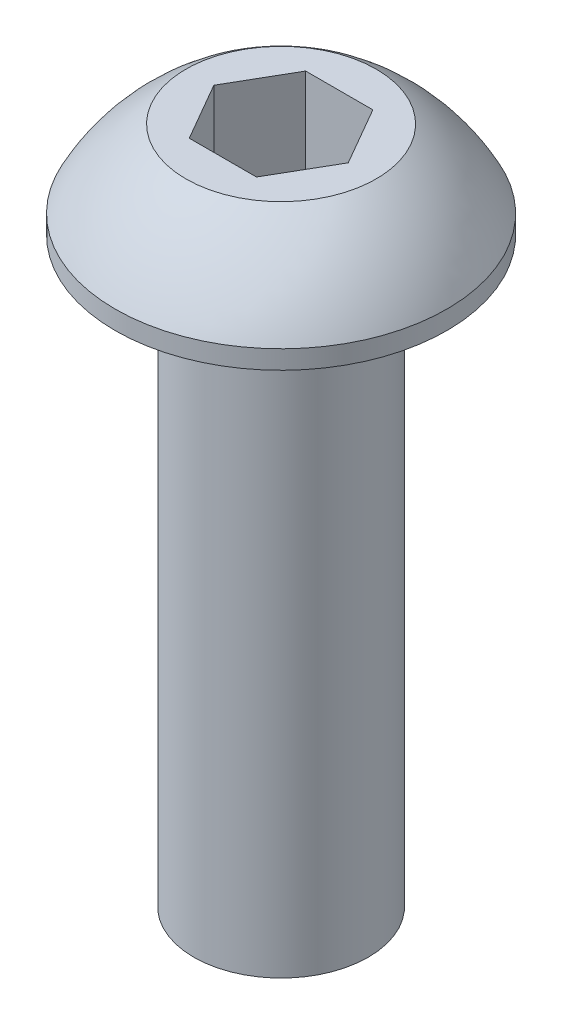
ISO-10303-21;
HEADER;
FILE_DESCRIPTION(('STEP AP214'),'2;1');
FILE_NAME('part.step','',(''),(''),'','','');
FILE_SCHEMA(('AUTOMOTIVE_DESIGN { 1 0 10303 214 1 1 1 1 }'));
ENDSEC;
DATA;
#1=APPLICATION_CONTEXT('core data for automotive mechanical design processes');
#2=APPLICATION_PROTOCOL_DEFINITION('international standard','automotive_design',2000,#1);
#3=PRODUCT_CONTEXT('',#1,'mechanical');
#4=PRODUCT('Part','Part','',(#3));
#5=PRODUCT_RELATED_PRODUCT_CATEGORY('part','',(#4));
#6=PRODUCT_DEFINITION_FORMATION('','',#4);
#7=PRODUCT_DEFINITION_CONTEXT('part definition',#1,'design');
#8=PRODUCT_DEFINITION('design','',#6,#7);
#9=PRODUCT_DEFINITION_SHAPE('','',#8);
#10=(LENGTH_UNIT() NAMED_UNIT(*) SI_UNIT(.MILLI.,.METRE.));
#11=(NAMED_UNIT(*) PLANE_ANGLE_UNIT() SI_UNIT($,.RADIAN.));
#12=(NAMED_UNIT(*) SI_UNIT($,.STERADIAN.) SOLID_ANGLE_UNIT());
#13=UNCERTAINTY_MEASURE_WITH_UNIT(LENGTH_MEASURE(1.E-05),#10,'distance_accuracy_value','');
#14=(GEOMETRIC_REPRESENTATION_CONTEXT(3) GLOBAL_UNCERTAINTY_ASSIGNED_CONTEXT((#13)) GLOBAL_UNIT_ASSIGNED_CONTEXT((#10,
#11,#12)) REPRESENTATION_CONTEXT('',''));
#15=CARTESIAN_POINT('',(0.,0.,0.));
#16=DIRECTION('',(0.,0.,1.));
#17=DIRECTION('',(1.,0.,0.));
#18=AXIS2_PLACEMENT_3D('',#15,#16,#17);
#19=CARTESIAN_POINT('',(0.,1.65,0.));
#20=DIRECTION('',(0.,-1.,0.));
#21=DIRECTION('',(0.,0.,-1.));
#22=AXIS2_PLACEMENT_3D('',#19,#20,#21);
#23=PLANE('',#22);
#24=DIRECTION('',(0.499999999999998,0.,-0.866025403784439));
#25=VECTOR('',#24,1.);
#26=CARTESIAN_POINT('',(0.577350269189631,1.65,1.));
#27=LINE('',#26,#25);
#28=CARTESIAN_POINT('',(0.577350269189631,1.65,1.));
#29=VERTEX_POINT('',#28);
#30=CARTESIAN_POINT('',(1.15470053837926,1.65,0.));
#31=VERTEX_POINT('',#30);
#32=EDGE_CURVE('E129',#29,#31,#27,.T.);
#33=ORIENTED_EDGE('',*,*,#32,.F.);
#34=DIRECTION('',(1.,0.,0.));
#35=VECTOR('',#34,1.);
#36=CARTESIAN_POINT('',(0.577350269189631,1.65,1.));
#37=LINE('',#36,#35);
#38=CARTESIAN_POINT('',(-0.577350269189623,1.65,1.));
#39=VERTEX_POINT('',#38);
#40=EDGE_CURVE('E55',#39,#29,#37,.T.);
#41=ORIENTED_EDGE('',*,*,#40,.F.);
#42=DIRECTION('',(0.500000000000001,0.,0.866025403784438));
#43=VECTOR('',#42,1.);
#44=CARTESIAN_POINT('',(-1.15470053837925,1.65,0.));
#45=LINE('',#44,#43);
#46=CARTESIAN_POINT('',(-1.15470053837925,1.65,0.));
#47=VERTEX_POINT('',#46);
#48=EDGE_CURVE('E138',#47,#39,#45,.T.);
#49=ORIENTED_EDGE('',*,*,#48,.F.);
#50=DIRECTION('',(-0.500000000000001,0.,0.866025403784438));
#51=VECTOR('',#50,1.);
#52=CARTESIAN_POINT('',(-1.15470053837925,1.65,0.));
#53=LINE('',#52,#51);
#54=CARTESIAN_POINT('',(-0.577350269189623,1.65,-1.));
#55=VERTEX_POINT('',#54);
#56=EDGE_CURVE('E136',#55,#47,#53,.T.);
#57=ORIENTED_EDGE('',*,*,#56,.F.);
#58=DIRECTION('',(-1.,0.,0.));
#59=VECTOR('',#58,1.);
#60=CARTESIAN_POINT('',(0.57735026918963,1.65,-1.));
#61=LINE('',#60,#59);
#62=CARTESIAN_POINT('',(0.57735026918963,1.65,-1.));
#63=VERTEX_POINT('',#62);
#64=EDGE_CURVE('E103',#63,#55,#61,.T.);
#65=ORIENTED_EDGE('',*,*,#64,.F.);
#66=DIRECTION('',(-0.499999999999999,0.,-0.866025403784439));
#67=VECTOR('',#66,1.);
#68=CARTESIAN_POINT('',(0.57735026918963,1.65,-1.));
#69=LINE('',#68,#67);
#70=EDGE_CURVE('E132',#31,#63,#69,.T.);
#71=ORIENTED_EDGE('',*,*,#70,.F.);
#72=EDGE_LOOP('',(#33,#41,#49,#57,#65,#71));
#73=FACE_BOUND('',#72,.T.);
#74=CARTESIAN_POINT('',(0.,1.65,0.));
#75=DIRECTION('',(0.,1.,0.));
#76=DIRECTION('',(0.,0.,1.));
#77=AXIS2_PLACEMENT_3D('',#74,#75,#76);
#78=CIRCLE('',#77,1.63497817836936);
#79=CARTESIAN_POINT('',(0.,1.65,1.63497817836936));
#80=VERTEX_POINT('',#79);
#81=EDGE_CURVE('E11',#80,#80,#78,.T.);
#82=ORIENTED_EDGE('',*,*,#81,.T.);
#83=EDGE_LOOP('',(#82));
#84=FACE_BOUND('',#83,.T.);
#85=ADVANCED_FACE('F41',(#73,#84),#23,.F.);
#86=CARTESIAN_POINT('',(0.,-1.20255616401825,0.));
#87=DIRECTION('',(0.,1.,0.));
#88=DIRECTION('',(0.,0.,1.));
#89=AXIS2_PLACEMENT_3D('',#86,#87,#88);
#90=DEGENERATE_TOROIDAL_SURFACE('',#89,0.151780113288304,3.36594442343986,.F.);
#91=ORIENTED_EDGE('',*,*,#81,.F.);
#92=EDGE_LOOP('',(#91));
#93=FACE_BOUND('',#92,.T.);
#94=CARTESIAN_POINT('',(0.,0.320236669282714,0.));
#95=DIRECTION('',(0.,1.,0.));
#96=DIRECTION('',(0.,0.,1.));
#97=AXIS2_PLACEMENT_3D('',#94,#95,#96);
#98=CIRCLE('',#97,2.85);
#99=CARTESIAN_POINT('',(0.,0.320236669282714,2.85));
#100=VERTEX_POINT('',#99);
#101=EDGE_CURVE('E48',#100,#100,#98,.T.);
#102=ORIENTED_EDGE('',*,*,#101,.T.);
#103=EDGE_LOOP('',(#102));
#104=FACE_BOUND('',#103,.T.);
#105=ADVANCED_FACE('F158',(#93,#104),#90,.F.);
#106=CARTESIAN_POINT('',(0.,9.90721096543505,0.));
#107=DIRECTION('',(0.,1.,0.));
#108=DIRECTION('',(0.,0.,1.));
#109=AXIS2_PLACEMENT_3D('',#106,#107,#108);
#110=CYLINDRICAL_SURFACE('',#109,2.85);
#111=ORIENTED_EDGE('',*,*,#101,.F.);
#112=EDGE_LOOP('',(#111));
#113=FACE_BOUND('',#112,.T.);
#114=CARTESIAN_POINT('',(0.,0.,0.));
#115=DIRECTION('',(0.,1.,0.));
#116=DIRECTION('',(0.,0.,1.));
#117=AXIS2_PLACEMENT_3D('',#114,#115,#116);
#118=CIRCLE('',#117,2.85);
#119=CARTESIAN_POINT('',(0.,0.,2.85));
#120=VERTEX_POINT('',#119);
#121=EDGE_CURVE('E153',#120,#120,#118,.T.);
#122=ORIENTED_EDGE('',*,*,#121,.T.);
#123=EDGE_LOOP('',(#122));
#124=FACE_BOUND('',#123,.T.);
#125=ADVANCED_FACE('F160',(#113,#124),#110,.T.);
#126=CARTESIAN_POINT('',(2.85,0.,0.));
#127=DIRECTION('',(0.,1.,0.));
#128=DIRECTION('',(0.,0.,1.));
#129=AXIS2_PLACEMENT_3D('',#126,#127,#128);
#130=PLANE('',#129);
#131=ORIENTED_EDGE('',*,*,#121,.F.);
#132=EDGE_LOOP('',(#131));
#133=FACE_BOUND('',#132,.T.);
#134=CARTESIAN_POINT('',(0.,0.,0.));
#135=DIRECTION('',(0.,1.,0.));
#136=DIRECTION('',(0.,0.,1.));
#137=AXIS2_PLACEMENT_3D('',#134,#135,#136);
#138=CIRCLE('',#137,1.5);
#139=CARTESIAN_POINT('',(0.,0.,1.5));
#140=VERTEX_POINT('',#139);
#141=EDGE_CURVE('E150',#140,#140,#138,.T.);
#142=ORIENTED_EDGE('',*,*,#141,.T.);
#143=EDGE_LOOP('',(#142));
#144=FACE_BOUND('',#143,.T.);
#145=ADVANCED_FACE('F163',(#133,#144),#130,.F.);
#146=CARTESIAN_POINT('',(0.,9.90721096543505,0.));
#147=DIRECTION('',(0.,1.,0.));
#148=DIRECTION('',(0.,0.,1.));
#149=AXIS2_PLACEMENT_3D('',#146,#147,#148);
#150=CYLINDRICAL_SURFACE('',#149,1.5);
#151=ORIENTED_EDGE('',*,*,#141,.F.);
#152=EDGE_LOOP('',(#151));
#153=FACE_BOUND('',#152,.T.);
#154=CARTESIAN_POINT('',(0.,-10.,0.));
#155=DIRECTION('',(0.,1.,0.));
#156=DIRECTION('',(0.,0.,1.));
#157=AXIS2_PLACEMENT_3D('',#154,#155,#156);
#158=CIRCLE('',#157,1.5);
#159=CARTESIAN_POINT('',(0.,-10.,1.5));
#160=VERTEX_POINT('',#159);
#161=EDGE_CURVE('E142',#160,#160,#158,.T.);
#162=ORIENTED_EDGE('',*,*,#161,.T.);
#163=EDGE_LOOP('',(#162));
#164=FACE_BOUND('',#163,.T.);
#165=ADVANCED_FACE('F169',(#153,#164),#150,.T.);
#166=CARTESIAN_POINT('',(1.5,-10.,0.));
#167=DIRECTION('',(0.,1.,0.));
#168=DIRECTION('',(0.,0.,1.));
#169=AXIS2_PLACEMENT_3D('',#166,#167,#168);
#170=PLANE('',#169);
#171=ORIENTED_EDGE('',*,*,#161,.F.);
#172=EDGE_LOOP('',(#171));
#173=FACE_BOUND('',#172,.T.);
#174=ADVANCED_FACE('F175',(#173),#170,.F.);
#175=CARTESIAN_POINT('',(0.577350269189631,0.125999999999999,1.));
#176=DIRECTION('',(0.,0.,1.));
#177=DIRECTION('',(1.,0.,0.));
#178=AXIS2_PLACEMENT_3D('',#175,#176,#177);
#179=PLANE('',#178);
#180=ORIENTED_EDGE('',*,*,#40,.T.);
#181=DIRECTION('',(0.,1.,0.));
#182=VECTOR('',#181,1.);
#183=CARTESIAN_POINT('',(0.577350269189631,0.125999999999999,1.));
#184=LINE('',#183,#182);
#185=CARTESIAN_POINT('',(0.577350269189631,0.125999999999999,1.));
#186=VERTEX_POINT('',#185);
#187=EDGE_CURVE('E85',#186,#29,#184,.T.);
#188=ORIENTED_EDGE('',*,*,#187,.F.);
#189=DIRECTION('',(1.,0.,0.));
#190=VECTOR('',#189,1.);
#191=CARTESIAN_POINT('',(0.577350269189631,0.125999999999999,1.));
#192=LINE('',#191,#190);
#193=CARTESIAN_POINT('',(-0.577350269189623,0.125999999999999,1.));
#194=VERTEX_POINT('',#193);
#195=EDGE_CURVE('E140',#194,#186,#192,.T.);
#196=ORIENTED_EDGE('',*,*,#195,.F.);
#197=DIRECTION('',(0.,1.,0.));
#198=VECTOR('',#197,1.);
#199=CARTESIAN_POINT('',(-0.577350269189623,0.125999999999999,1.));
#200=LINE('',#199,#198);
#201=EDGE_CURVE('E63',#194,#39,#200,.T.);
#202=ORIENTED_EDGE('',*,*,#201,.T.);
#203=EDGE_LOOP('',(#180,#188,#196,#202));
#204=FACE_BOUND('',#203,.T.);
#205=ADVANCED_FACE('F180',(#204),#179,.F.);
#206=CARTESIAN_POINT('',(-1.15470053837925,0.125999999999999,0.));
#207=DIRECTION('',(-0.866025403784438,0.,0.500000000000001));
#208=DIRECTION('',(0.500000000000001,0.,0.866025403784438));
#209=AXIS2_PLACEMENT_3D('',#206,#207,#208);
#210=PLANE('',#209);
#211=ORIENTED_EDGE('',*,*,#48,.T.);
#212=ORIENTED_EDGE('',*,*,#201,.F.);
#213=DIRECTION('',(0.500000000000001,0.,0.866025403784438));
#214=VECTOR('',#213,1.);
#215=CARTESIAN_POINT('',(-1.15470053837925,0.125999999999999,0.));
#216=LINE('',#215,#214);
#217=CARTESIAN_POINT('',(-1.15470053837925,0.125999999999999,0.));
#218=VERTEX_POINT('',#217);
#219=EDGE_CURVE('E115',#218,#194,#216,.T.);
#220=ORIENTED_EDGE('',*,*,#219,.F.);
#221=DIRECTION('',(0.,1.,0.));
#222=VECTOR('',#221,1.);
#223=CARTESIAN_POINT('',(-1.15470053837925,0.125999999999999,0.));
#224=LINE('',#223,#222);
#225=EDGE_CURVE('E107',#218,#47,#224,.T.);
#226=ORIENTED_EDGE('',*,*,#225,.T.);
#227=EDGE_LOOP('',(#211,#212,#220,#226));
#228=FACE_BOUND('',#227,.T.);
#229=ADVANCED_FACE('F186',(#228),#210,.F.);
#230=CARTESIAN_POINT('',(-1.15470053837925,0.125999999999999,0.));
#231=DIRECTION('',(-0.866025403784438,0.,-0.500000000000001));
#232=DIRECTION('',(-0.500000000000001,0.,0.866025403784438));
#233=AXIS2_PLACEMENT_3D('',#230,#231,#232);
#234=PLANE('',#233);
#235=ORIENTED_EDGE('',*,*,#56,.T.);
#236=ORIENTED_EDGE('',*,*,#225,.F.);
#237=DIRECTION('',(-0.500000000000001,0.,0.866025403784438));
#238=VECTOR('',#237,1.);
#239=CARTESIAN_POINT('',(-1.15470053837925,0.125999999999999,0.));
#240=LINE('',#239,#238);
#241=CARTESIAN_POINT('',(-0.577350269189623,0.125999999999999,-1.));
#242=VERTEX_POINT('',#241);
#243=EDGE_CURVE('E111',#242,#218,#240,.T.);
#244=ORIENTED_EDGE('',*,*,#243,.F.);
#245=DIRECTION('',(0.,1.,0.));
#246=VECTOR('',#245,1.);
#247=CARTESIAN_POINT('',(-0.577350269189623,0.125999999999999,-1.));
#248=LINE('',#247,#246);
#249=EDGE_CURVE('E96',#242,#55,#248,.T.);
#250=ORIENTED_EDGE('',*,*,#249,.T.);
#251=EDGE_LOOP('',(#235,#236,#244,#250));
#252=FACE_BOUND('',#251,.T.);
#253=ADVANCED_FACE('F112',(#252),#234,.F.);
#254=CARTESIAN_POINT('',(0.57735026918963,0.125999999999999,-1.));
#255=DIRECTION('',(0.,0.,-1.));
#256=DIRECTION('',(-1.,0.,0.));
#257=AXIS2_PLACEMENT_3D('',#254,#255,#256);
#258=PLANE('',#257);
#259=ORIENTED_EDGE('',*,*,#64,.T.);
#260=ORIENTED_EDGE('',*,*,#249,.F.);
#261=DIRECTION('',(-1.,0.,0.));
#262=VECTOR('',#261,1.);
#263=CARTESIAN_POINT('',(0.57735026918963,0.125999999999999,-1.));
#264=LINE('',#263,#262);
#265=CARTESIAN_POINT('',(0.57735026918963,0.125999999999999,-1.));
#266=VERTEX_POINT('',#265);
#267=EDGE_CURVE('E100',#266,#242,#264,.T.);
#268=ORIENTED_EDGE('',*,*,#267,.F.);
#269=DIRECTION('',(0.,1.,0.));
#270=VECTOR('',#269,1.);
#271=CARTESIAN_POINT('',(0.57735026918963,0.125999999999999,-1.));
#272=LINE('',#271,#270);
#273=EDGE_CURVE('E108',#266,#63,#272,.T.);
#274=ORIENTED_EDGE('',*,*,#273,.T.);
#275=EDGE_LOOP('',(#259,#260,#268,#274));
#276=FACE_BOUND('',#275,.T.);
#277=ADVANCED_FACE('F98',(#276),#258,.F.);
#278=CARTESIAN_POINT('',(0.57735026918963,0.125999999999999,-1.));
#279=DIRECTION('',(0.866025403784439,0.,-0.499999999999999));
#280=DIRECTION('',(-0.499999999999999,0.,-0.866025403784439));
#281=AXIS2_PLACEMENT_3D('',#278,#279,#280);
#282=PLANE('',#281);
#283=ORIENTED_EDGE('',*,*,#70,.T.);
#284=ORIENTED_EDGE('',*,*,#273,.F.);
#285=DIRECTION('',(-0.499999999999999,0.,-0.866025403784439));
#286=VECTOR('',#285,1.);
#287=CARTESIAN_POINT('',(0.57735026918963,0.125999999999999,-1.));
#288=LINE('',#287,#286);
#289=CARTESIAN_POINT('',(1.15470053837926,0.125999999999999,0.));
#290=VERTEX_POINT('',#289);
#291=EDGE_CURVE('E121',#290,#266,#288,.T.);
#292=ORIENTED_EDGE('',*,*,#291,.F.);
#293=DIRECTION('',(0.,1.,0.));
#294=VECTOR('',#293,1.);
#295=CARTESIAN_POINT('',(1.15470053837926,0.125999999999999,0.));
#296=LINE('',#295,#294);
#297=EDGE_CURVE('E145',#290,#31,#296,.T.);
#298=ORIENTED_EDGE('',*,*,#297,.T.);
#299=EDGE_LOOP('',(#283,#284,#292,#298));
#300=FACE_BOUND('',#299,.T.);
#301=ADVANCED_FACE('F211',(#300),#282,.F.);
#302=CARTESIAN_POINT('',(0.577350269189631,0.125999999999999,1.));
#303=DIRECTION('',(0.86602540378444,0.,0.499999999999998));
#304=DIRECTION('',(0.499999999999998,0.,-0.86602540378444));
#305=AXIS2_PLACEMENT_3D('',#302,#303,#304);
#306=PLANE('',#305);
#307=ORIENTED_EDGE('',*,*,#32,.T.);
#308=ORIENTED_EDGE('',*,*,#297,.F.);
#309=DIRECTION('',(0.499999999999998,0.,-0.866025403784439));
#310=VECTOR('',#309,1.);
#311=CARTESIAN_POINT('',(0.577350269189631,0.125999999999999,1.));
#312=LINE('',#311,#310);
#313=EDGE_CURVE('E123',#186,#290,#312,.T.);
#314=ORIENTED_EDGE('',*,*,#313,.F.);
#315=ORIENTED_EDGE('',*,*,#187,.T.);
#316=EDGE_LOOP('',(#307,#308,#314,#315));
#317=FACE_BOUND('',#316,.T.);
#318=ADVANCED_FACE('F199',(#317),#306,.F.);
#319=CARTESIAN_POINT('',(0.577350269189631,0.125999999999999,1.));
#320=DIRECTION('',(0.,-1.,0.));
#321=DIRECTION('',(0.,0.,-1.));
#322=AXIS2_PLACEMENT_3D('',#319,#320,#321);
#323=PLANE('',#322);
#324=ORIENTED_EDGE('',*,*,#195,.T.);
#325=ORIENTED_EDGE('',*,*,#313,.T.);
#326=ORIENTED_EDGE('',*,*,#291,.T.);
#327=ORIENTED_EDGE('',*,*,#267,.T.);
#328=ORIENTED_EDGE('',*,*,#243,.T.);
#329=ORIENTED_EDGE('',*,*,#219,.T.);
#330=EDGE_LOOP('',(#324,#325,#326,#327,#328,#329));
#331=FACE_BOUND('',#330,.T.);
#332=ADVANCED_FACE('F118',(#331),#323,.F.);
#333=CLOSED_SHELL('',(#85,#105,#125,#145,#165,#174,#205,#229,#253,#277,#301,#318,#332));
#334=MANIFOLD_SOLID_BREP('B2',#333);
#335=ADVANCED_BREP_SHAPE_REPRESENTATION('',(#18,#334),#14);
#336=SHAPE_DEFINITION_REPRESENTATION(#9,#335);
ENDSEC;
END-ISO-10303-21;
